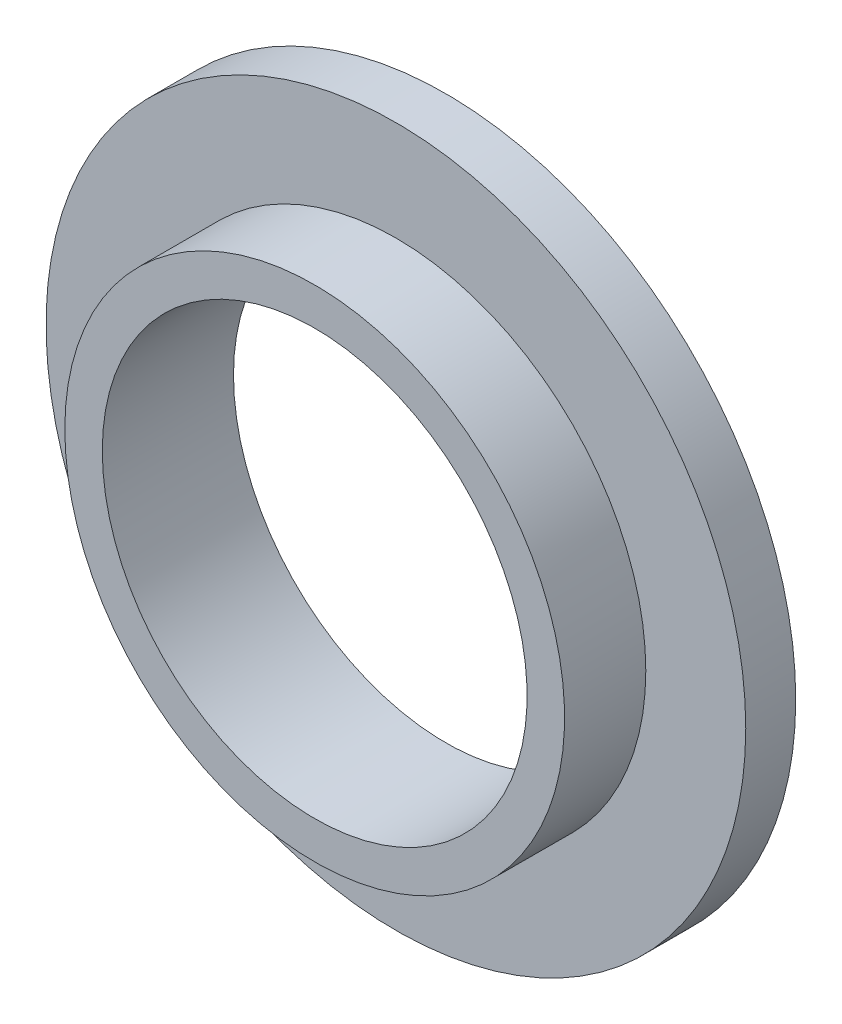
from build123d import *

# Parameters (mm, degrees)
SKETCH_1_R      = 14
SKETCH_1_R_2    = 8.5
EXTRUDE_1_DEPTH = 2
SKETCH_2_R      = 10
SKETCH_2_R_2    = 8.5
EXTRUDE_2_DEPTH = 3.25


with BuildPart() as part:
    # Sketch 1 → Extrude 1 (new body)
    with BuildSketch(Plane.XY):
        Circle(SKETCH_1_R)
        Circle(SKETCH_1_R_2, mode=Mode.SUBTRACT)
    extrude(amount=EXTRUDE_1_DEPTH)

    # Sketch 2 → Extrude 2 (add)
    with BuildSketch(Plane.XY.offset(2)):
        with Locations(Location((0, 0, 0), (0, 0, 180))):
            Circle(SKETCH_2_R)
        with Locations(Location((0, 0, 0), (0, 0, 180))):
            Circle(SKETCH_2_R_2, mode=Mode.SUBTRACT)
    extrude(amount=EXTRUDE_2_DEPTH)


solid = part.part
